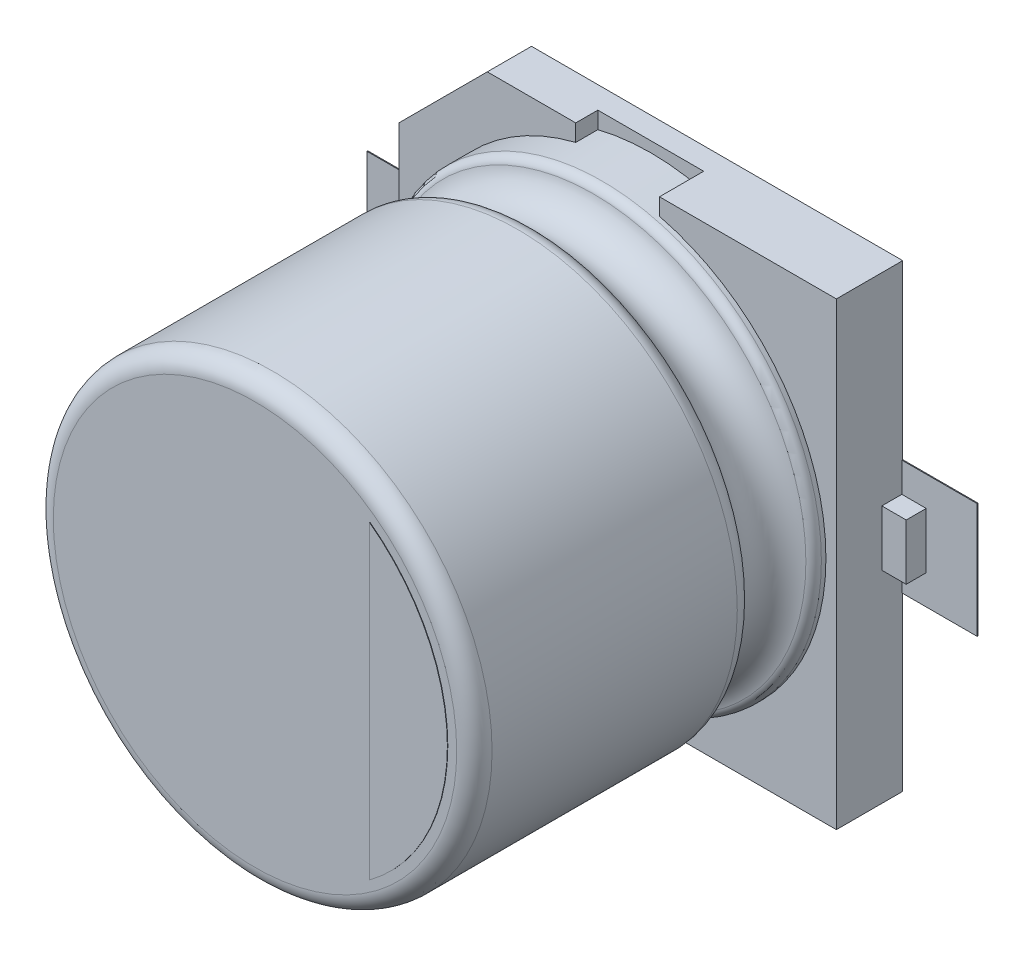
ISO-10303-21;
HEADER;
FILE_DESCRIPTION(('STEP AP214'),'2;1');
FILE_NAME('part.step','',(''),(''),'','','');
FILE_SCHEMA(('AUTOMOTIVE_DESIGN { 1 0 10303 214 1 1 1 1 }'));
ENDSEC;
DATA;
#1=APPLICATION_CONTEXT('core data for automotive mechanical design processes');
#2=APPLICATION_PROTOCOL_DEFINITION('international standard','automotive_design',2000,#1);
#3=PRODUCT_CONTEXT('',#1,'mechanical');
#4=PRODUCT('Part','Part','',(#3));
#5=PRODUCT_RELATED_PRODUCT_CATEGORY('part','',(#4));
#6=PRODUCT_DEFINITION_FORMATION('','',#4);
#7=PRODUCT_DEFINITION_CONTEXT('part definition',#1,'design');
#8=PRODUCT_DEFINITION('design','',#6,#7);
#9=PRODUCT_DEFINITION_SHAPE('','',#8);
#10=(LENGTH_UNIT() NAMED_UNIT(*) SI_UNIT(.MILLI.,.METRE.));
#11=(NAMED_UNIT(*) PLANE_ANGLE_UNIT() SI_UNIT($,.RADIAN.));
#12=(NAMED_UNIT(*) SI_UNIT($,.STERADIAN.) SOLID_ANGLE_UNIT());
#13=UNCERTAINTY_MEASURE_WITH_UNIT(LENGTH_MEASURE(1.E-05),#10,'distance_accuracy_value','');
#14=(GEOMETRIC_REPRESENTATION_CONTEXT(3) GLOBAL_UNCERTAINTY_ASSIGNED_CONTEXT((#13)) GLOBAL_UNIT_ASSIGNED_CONTEXT((#10,
#11,#12)) REPRESENTATION_CONTEXT('',''));
#15=CARTESIAN_POINT('',(0.,0.,0.));
#16=DIRECTION('',(0.,0.,1.));
#17=DIRECTION('',(1.,0.,0.));
#18=AXIS2_PLACEMENT_3D('',#15,#16,#17);
#19=CARTESIAN_POINT('',(0.,0.,6.082538));
#20=DIRECTION('',(0.,0.,1.));
#21=DIRECTION('',(1.,0.,0.));
#22=AXIS2_PLACEMENT_3D('',#19,#20,#21);
#23=PLANE('',#22);
#24=CARTESIAN_POINT('',(0.,0.,6.082538));
#25=DIRECTION('',(0.,0.,1.));
#26=DIRECTION('',(1.,0.,0.));
#27=AXIS2_PLACEMENT_3D('',#24,#25,#26);
#28=CIRCLE('',#27,2.7686291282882);
#29=CARTESIAN_POINT('',(1.651,2.22250000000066,6.082538));
#30=VERTEX_POINT('',#29);
#31=CARTESIAN_POINT('',(1.651,-2.22250000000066,6.082538));
#32=VERTEX_POINT('',#31);
#33=EDGE_CURVE('E235',#30,#32,#28,.F.);
#34=ORIENTED_EDGE('',*,*,#33,.F.);
#35=DIRECTION('',(0.,1.,0.));
#36=VECTOR('',#35,1.);
#37=CARTESIAN_POINT('',(1.651,2.2225,6.082538));
#38=LINE('',#37,#36);
#39=EDGE_CURVE('E229',#32,#30,#38,.T.);
#40=ORIENTED_EDGE('',*,*,#39,.F.);
#41=EDGE_LOOP('',(#34,#40));
#42=FACE_BOUND('',#41,.T.);
#43=ADVANCED_FACE('F16',(#42),#23,.T.);
#44=CARTESIAN_POINT('',(0.,0.,6.076188));
#45=DIRECTION('',(0.,0.,1.));
#46=DIRECTION('',(1.,0.,0.));
#47=AXIS2_PLACEMENT_3D('',#44,#45,#46);
#48=CYLINDRICAL_SURFACE('',#47,2.7686291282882);
#49=DIRECTION('',(0.,0.,1.));
#50=VECTOR('',#49,1.);
#51=CARTESIAN_POINT('',(1.651,-2.2225,6.076188));
#52=LINE('',#51,#50);
#53=CARTESIAN_POINT('',(1.651,-2.22250000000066,6.076188));
#54=VERTEX_POINT('',#53);
#55=EDGE_CURVE('E238',#54,#32,#52,.T.);
#56=ORIENTED_EDGE('',*,*,#55,.F.);
#57=CARTESIAN_POINT('',(0.,0.,6.076188));
#58=DIRECTION('',(0.,0.,1.));
#59=DIRECTION('',(1.,0.,0.));
#60=AXIS2_PLACEMENT_3D('',#57,#58,#59);
#61=CIRCLE('',#60,2.7686291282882);
#62=CARTESIAN_POINT('',(1.651,2.22250000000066,6.076188));
#63=VERTEX_POINT('',#62);
#64=EDGE_CURVE('E248',#63,#54,#61,.F.);
#65=ORIENTED_EDGE('',*,*,#64,.F.);
#66=DIRECTION('',(0.,0.,1.));
#67=VECTOR('',#66,1.);
#68=CARTESIAN_POINT('',(1.651,2.2225,6.076188));
#69=LINE('',#68,#67);
#70=EDGE_CURVE('E240',#30,#63,#69,.F.);
#71=ORIENTED_EDGE('',*,*,#70,.F.);
#72=ORIENTED_EDGE('',*,*,#33,.T.);
#73=EDGE_LOOP('',(#56,#65,#71,#72));
#74=FACE_BOUND('',#73,.T.);
#75=ADVANCED_FACE('F236',(#74),#48,.T.);
#76=CARTESIAN_POINT('',(1.651,2.2225,6.076188));
#77=DIRECTION('',(-1.,0.,0.));
#78=DIRECTION('',(0.,0.,1.));
#79=AXIS2_PLACEMENT_3D('',#76,#77,#78);
#80=PLANE('',#79);
#81=ORIENTED_EDGE('',*,*,#70,.T.);
#82=DIRECTION('',(0.,1.,0.));
#83=VECTOR('',#82,1.);
#84=CARTESIAN_POINT('',(1.651,0.,6.076188));
#85=LINE('',#84,#83);
#86=EDGE_CURVE('E245',#54,#63,#85,.T.);
#87=ORIENTED_EDGE('',*,*,#86,.F.);
#88=ORIENTED_EDGE('',*,*,#55,.T.);
#89=ORIENTED_EDGE('',*,*,#39,.T.);
#90=EDGE_LOOP('',(#81,#87,#88,#89));
#91=FACE_BOUND('',#90,.T.);
#92=ADVANCED_FACE('F243',(#91),#80,.T.);
#93=CARTESIAN_POINT('',(0.,0.,6.076188));
#94=DIRECTION('',(0.,0.,1.));
#95=DIRECTION('',(1.,0.,0.));
#96=AXIS2_PLACEMENT_3D('',#93,#94,#95);
#97=PLANE('',#96);
#98=ORIENTED_EDGE('',*,*,#64,.T.);
#99=ORIENTED_EDGE('',*,*,#86,.T.);
#100=EDGE_LOOP('',(#98,#99));
#101=FACE_BOUND('',#100,.T.);
#102=CARTESIAN_POINT('',(2.8959999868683,0.,6.076188));
#103=CARTESIAN_POINT('',(2.89600001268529,-0.00294739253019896,6.07618799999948));
#104=CARTESIAN_POINT('',(2.89599565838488,-0.00589479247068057,6.07618800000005));
#105=CARTESIAN_POINT('',(2.89598256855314,-0.010334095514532,6.07618799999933));
#106=CARTESIAN_POINT('',(2.8959770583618,-0.0118260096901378,6.07618799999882));
#107=CARTESIAN_POINT('',(2.89596377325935,-0.0148219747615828,6.0761879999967));
#108=CARTESIAN_POINT('',(2.89595598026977,-0.0163260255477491,6.07618799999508));
#109=CARTESIAN_POINT('',(2.89566917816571,-0.0644472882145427,6.07618799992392));
#110=CARTESIAN_POINT('',(2.89426628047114,-0.111065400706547,6.07618799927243));
#111=CARTESIAN_POINT('',(2.88921073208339,-0.204175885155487,6.07618799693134));
#112=CARTESIAN_POINT('',(2.88555805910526,-0.250668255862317,6.07618799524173));
#113=CARTESIAN_POINT('',(2.87601221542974,-0.343423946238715,6.07618799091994));
#114=CARTESIAN_POINT('',(2.87011902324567,-0.389687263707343,6.07618798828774));
#115=CARTESIAN_POINT('',(2.85610563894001,-0.48187552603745,6.07618798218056));
#116=CARTESIAN_POINT('',(2.84798542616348,-0.527800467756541,6.07618797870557));
#117=CARTESIAN_POINT('',(2.82953695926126,-0.619205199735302,6.07618797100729));
#118=CARTESIAN_POINT('',(2.81920868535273,-0.664684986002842,6.07618796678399));
#119=CARTESIAN_POINT('',(2.79636814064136,-0.755093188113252,6.07618795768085));
#120=CARTESIAN_POINT('',(2.78385585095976,-0.80002159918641,6.076187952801));
#121=CARTESIAN_POINT('',(2.75667642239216,-0.889222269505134,6.07618794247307));
#122=CARTESIAN_POINT('',(2.74200926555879,-0.93349452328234,6.07618793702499));
#123=CARTESIAN_POINT('',(2.7105543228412,-1.02127949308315,6.07618792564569));
#124=CARTESIAN_POINT('',(2.69376651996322,-1.06479220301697,6.07618791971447));
#125=CARTESIAN_POINT('',(2.65781622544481,-1.15166500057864,6.07618790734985));
#126=CARTESIAN_POINT('',(2.63861922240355,-1.1950108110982,6.0761879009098));
#127=CARTESIAN_POINT('',(2.59812093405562,-1.28070832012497,6.07618788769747));
#128=CARTESIAN_POINT('',(2.57681963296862,-1.32306001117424,6.0761878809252));
#129=CARTESIAN_POINT('',(2.53216403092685,-1.40666726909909,6.07618786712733));
#130=CARTESIAN_POINT('',(2.50880971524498,-1.44792282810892,6.07618786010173));
#131=CARTESIAN_POINT('',(2.46010435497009,-1.52923834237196,6.07618784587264));
#132=CARTESIAN_POINT('',(2.43475329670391,-1.56929828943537,6.07618783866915));
#133=CARTESIAN_POINT('',(2.38211552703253,-1.64812601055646,6.07618782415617));
#134=CARTESIAN_POINT('',(2.35482880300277,-1.68689377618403,6.07618781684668));
#135=CARTESIAN_POINT('',(2.29838544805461,-1.76304367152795,6.07618780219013));
#136=CARTESIAN_POINT('',(2.26922880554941,-1.80042579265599,6.07618779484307));
#137=CARTESIAN_POINT('',(2.20911586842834,-1.87371427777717,6.07618778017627));
#138=CARTESIAN_POINT('',(2.17815956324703,-1.90962063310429,6.07618777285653));
#139=CARTESIAN_POINT('',(2.11452189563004,-1.97987102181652,6.0761877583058));
#140=CARTESIAN_POINT('',(2.08184052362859,-2.0142150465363,6.07618775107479));
#141=CARTESIAN_POINT('',(2.01483147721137,-2.08125797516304,6.07618773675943));
#142=CARTESIAN_POINT('',(1.98050379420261,-2.11395687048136,6.07618772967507));
#143=CARTESIAN_POINT('',(1.91028485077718,-2.17763070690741,6.07618771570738));
#144=CARTESIAN_POINT('',(1.87439358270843,-2.20860563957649,6.07618770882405));
#145=CARTESIAN_POINT('',(1.80113396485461,-2.26875687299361,6.07618769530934));
#146=CARTESIAN_POINT('',(1.7637656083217,-2.29793316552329,6.07618768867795));
#147=CARTESIAN_POINT('',(1.68764187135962,-2.35441677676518,6.0761876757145));
#148=CARTESIAN_POINT('',(1.64888648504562,-2.38172408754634,6.07618766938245));
#149=CARTESIAN_POINT('',(1.57008209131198,-2.43440389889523,6.07618765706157));
#150=CARTESIAN_POINT('',(1.53003307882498,-2.45977639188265,6.07618765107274));
#151=CARTESIAN_POINT('',(1.44873795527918,-2.50852539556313,6.0761876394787));
#152=CARTESIAN_POINT('',(1.40749183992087,-2.53190189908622,6.07618763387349));
#153=CARTESIAN_POINT('',(1.32390192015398,-2.57660256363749,6.07618762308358));
#154=CARTESIAN_POINT('',(1.28155811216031,-2.59792671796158,6.07618761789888));
#155=CARTESIAN_POINT('',(1.19587486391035,-2.63847127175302,6.07618760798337));
#156=CARTESIAN_POINT('',(1.15253542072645,-2.6576916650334,6.07618760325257));
#157=CARTESIAN_POINT('',(1.06496536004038,-2.69398235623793,6.07618759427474));
#158=CARTESIAN_POINT('',(1.0207347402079,-2.71105264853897,6.07618759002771));
#159=CARTESIAN_POINT('',(0.93148893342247,-2.74300198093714,6.07618758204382));
#160=CARTESIAN_POINT('',(0.886473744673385,-2.75788101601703,6.07618757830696));
#161=CARTESIAN_POINT('',(0.795767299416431,-2.78541196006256,6.07618757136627));
#162=CARTESIAN_POINT('',(0.750076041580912,-2.79806386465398,6.07618756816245));
#163=CARTESIAN_POINT('',(0.658127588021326,-2.82111004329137,6.07618756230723));
#164=CARTESIAN_POINT('',(0.61187039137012,-2.8315043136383,6.07618755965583));
#165=CARTESIAN_POINT('',(0.518901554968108,-2.85001016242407,6.07618755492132));
#166=CARTESIAN_POINT('',(0.47218991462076,-2.85812173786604,6.07618755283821));
#167=CARTESIAN_POINT('',(0.378424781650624,-2.87204263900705,6.07618754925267));
#168=CARTESIAN_POINT('',(0.331371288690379,-2.87785196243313,6.07618754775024));
#169=CARTESIAN_POINT('',(0.237035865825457,-2.88715435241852,6.0761875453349));
#170=CARTESIAN_POINT('',(0.189753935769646,-2.89064741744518,6.07618754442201));
#171=CARTESIAN_POINT('',(0.09507560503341,-2.89530886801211,6.07618754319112));
#172=CARTESIAN_POINT('',(0.047679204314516,-2.89647725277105,6.07618754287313));
#173=CARTESIAN_POINT('',(-0.0471138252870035,-2.8964865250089,6.07618754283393));
#174=CARTESIAN_POINT('',(-0.0945104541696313,-2.89532741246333,6.07618754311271));
#175=CARTESIAN_POINT('',(-0.189189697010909,-2.89068448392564,6.07618754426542));
#176=CARTESIAN_POINT('',(-0.236472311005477,-2.88720066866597,6.07618754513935));
#177=CARTESIAN_POINT('',(-0.330809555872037,-2.87791673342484,6.0761875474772));
#178=CARTESIAN_POINT('',(-0.377864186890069,-2.87211661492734,6.07618754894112));
#179=CARTESIAN_POINT('',(-0.471632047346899,-2.85821405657,6.07618755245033));
#180=CARTESIAN_POINT('',(-0.518345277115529,-2.85011161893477,6.07618755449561));
#181=CARTESIAN_POINT('',(-0.611317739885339,-2.83162395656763,6.0761875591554));
#182=CARTESIAN_POINT('',(-0.657576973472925,-2.8212387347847,6.0761875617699));
#183=CARTESIAN_POINT('',(-0.749529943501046,-2.7982105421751,6.07618756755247));
#184=CARTESIAN_POINT('',(-0.795223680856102,-2.78556757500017,6.07618757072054));
#185=CARTESIAN_POINT('',(-0.885935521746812,-2.75805437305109,6.0761875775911));
#186=CARTESIAN_POINT('',(-0.930953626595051,-2.74318414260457,6.0761875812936));
#187=CARTESIAN_POINT('',(-1.02020569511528,-2.71125226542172,6.07618758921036));
#188=CARTESIAN_POINT('',(-1.06443966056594,-2.6941906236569,6.07618759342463));
#189=CARTESIAN_POINT('',(-1.15201683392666,-2.65791705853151,6.07618760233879));
#190=CARTESIAN_POINT('',(-1.19536004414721,-2.63870514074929,6.07618760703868));
#191=CARTESIAN_POINT('',(-1.28105123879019,-2.59817734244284,6.07618761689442));
#192=CARTESIAN_POINT('',(-1.32339922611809,-2.57686146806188,6.07618762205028));
#193=CARTESIAN_POINT('',(-1.40699790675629,-2.53217714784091,6.0761876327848));
#194=CARTESIAN_POINT('',(-1.44824860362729,-2.5088087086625,6.07618763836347));
#195=CARTESIAN_POINT('',(-1.52955328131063,-2.46007559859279,6.07618764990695));
#196=CARTESIAN_POINT('',(-1.56960726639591,-2.43471093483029,6.07618765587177));
#197=CARTESIAN_POINT('',(-1.64842198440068,-2.38204652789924,6.07618766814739));
#198=CARTESIAN_POINT('',(-1.68718272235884,-2.35474679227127,6.0761876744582));
#199=CARTESIAN_POINT('',(-1.76331752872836,-2.2982780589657,6.07618768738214));
#200=CARTESIAN_POINT('',(-1.80069160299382,-2.26910906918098,6.07618769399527));
#201=CARTESIAN_POINT('',(-1.87396300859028,-2.20897215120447,6.07618770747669));
#202=CARTESIAN_POINT('',(-1.90986034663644,-2.17800423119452,6.07618771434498));
#203=CARTESIAN_POINT('',(-1.98009176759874,-2.11434411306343,6.07618772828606));
#204=CARTESIAN_POINT('',(-2.01442585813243,-2.08165192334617,6.07618773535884));
#205=CARTESIAN_POINT('',(-2.08144804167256,-2.01462208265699,6.07618774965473));
#206=CARTESIAN_POINT('',(-2.11413614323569,-1.98028444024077,6.07618775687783));
#207=CARTESIAN_POINT('',(-2.17778757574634,-1.91004647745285,6.07618777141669));
#208=CARTESIAN_POINT('',(-2.20875091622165,-1.87414616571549,6.07618777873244));
#209=CARTESIAN_POINT('',(-2.26887821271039,-1.80086941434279,6.07618779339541));
#210=CARTESIAN_POINT('',(-2.29804217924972,-1.76349298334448,6.07618780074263));
#211=CARTESIAN_POINT('',(-2.3545004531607,-1.68735410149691,6.07618781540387));
#212=CARTESIAN_POINT('',(-2.38179477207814,-1.64859165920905,6.07618782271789));
#213=CARTESIAN_POINT('',(-2.43444798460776,-1.56977420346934,6.07618783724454));
#214=CARTESIAN_POINT('',(-2.45980689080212,-1.52971919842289,6.07618784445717));
#215=CARTESIAN_POINT('',(-2.50852817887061,-1.44841318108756,6.07618785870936));
#216=CARTESIAN_POINT('',(-2.53189057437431,-1.40716217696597,6.07618786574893));
#217=CARTESIAN_POINT('',(-2.57656255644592,-1.32356360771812,6.0761878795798));
#218=CARTESIAN_POINT('',(-2.59787215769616,-1.28121605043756,6.07618788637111));
#219=CARTESIAN_POINT('',(-2.6383872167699,-1.19552646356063,6.07618789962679));
#220=CARTESIAN_POINT('',(-2.65759269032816,-1.15218444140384,6.07618790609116));
#221=CARTESIAN_POINT('',(-2.69385323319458,-1.06461040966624,6.07618791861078));
#222=CARTESIAN_POINT('',(-2.71090831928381,-1.02037840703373,6.07618792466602));
#223=CARTESIAN_POINT('',(-2.74282701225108,-0.931131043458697,6.07618793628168));
#224=CARTESIAN_POINT('',(-2.75769063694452,-0.88611568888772,6.0761879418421));
#225=CARTESIAN_POINT('',(-2.78519061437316,-0.795410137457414,6.07618795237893));
#226=CARTESIAN_POINT('',(-2.79782698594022,-0.749719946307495,6.07618795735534));
#227=CARTESIAN_POINT('',(-2.82084204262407,-0.657774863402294,6.07618796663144));
#228=CARTESIAN_POINT('',(-2.83122074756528,-0.611519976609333,6.07618797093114));
#229=CARTESIAN_POINT('',(-2.84969547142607,-0.518557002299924,6.07618797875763));
#230=CARTESIAN_POINT('',(-2.8577915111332,-0.471848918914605,6.07618798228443));
#231=CARTESIAN_POINT('',(-2.87168151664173,-0.378092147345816,6.07618798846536));
#232=CARTESIAN_POINT('',(-2.8774755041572,-0.331043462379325,6.07618799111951));
#233=CARTESIAN_POINT('',(-2.88674716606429,-0.23671888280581,6.07618799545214));
#234=CARTESIAN_POINT('',(-2.89022486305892,-0.189442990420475,6.07618799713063));
#235=CARTESIAN_POINT('',(-2.89485678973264,-0.0947780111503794,6.0761879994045));
#236=CARTESIAN_POINT('',(-2.89601104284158,-0.047388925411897,6.07618799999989));
#237=CARTESIAN_POINT('',(-2.8959999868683,0.,6.076188));
#238=B_SPLINE_CURVE_WITH_KNOTS('',3,(#102,#103,#104,#105,#106,#107,#108,#109,#110,#111,#112,
#113,#114,#115,#116,#117,#118,#119,#120,#121,#122,#123,#124,#125,#126,#127,#128,#129,#130,#131,
#132,#133,#134,#135,#136,#137,#138,#139,#140,#141,#142,#143,#144,#145,#146,#147,#148,#149,#150,
#151,#152,#153,#154,#155,#156,#157,#158,#159,#160,#161,#162,#163,#164,#165,#166,#167,#168,#169,
#170,#171,#172,#173,#174,#175,#176,#177,#178,#179,#180,#181,#182,#183,#184,#185,#186,#187,#188,
#189,#190,#191,#192,#193,#194,#195,#196,#197,#198,#199,#200,#201,#202,#203,#204,#205,#206,#207,
#208,#209,#210,#211,#212,#213,#214,#215,#216,#217,#218,#219,#220,#221,#222,#223,#224,#225,#226,
#227,#228,#229,#230,#231,#232,#233,#234,#235,#236,#237),.UNSPECIFIED.,.F.,.F.,(4,2,2,2,2,2,2,2,
2,2,2,2,2,2,2,2,2,2,2,2,2,2,2,2,2,2,2,2,2,2,2,2,2,2,2,2,2,2,2,2,2,2,2,2,2,2,2,2,2,2,2,2,2,2,2,2,
2,2,2,2,2,2,2,2,2,2,2,4),(0.,0.00884218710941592,0.0133179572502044,0.0178301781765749,
0.157683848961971,0.297538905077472,0.437395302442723,0.577252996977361,0.717111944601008,
0.856972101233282,0.996833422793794,1.13669586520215,1.27885832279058,1.42102184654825,
1.56318639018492,1.70535190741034,1.84751835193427,1.98968567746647,2.13185383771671,
2.27402278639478,2.41619247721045,2.55836286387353,2.70053390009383,2.84270553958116,
2.98487773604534,3.12705044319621,3.26922361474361,3.41139720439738,3.5535711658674,
3.69574545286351,3.8379200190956,3.98009481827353,4.12226980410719,4.26444493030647,
4.40662015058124,4.54879541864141,4.69097068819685,4.83314591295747,4.97532104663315,
5.11749604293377,5.25967085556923,5.4018454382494,5.54401974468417,5.6861937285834,
5.82836734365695,5.9705405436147,6.11271328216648,6.25488551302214,6.39705718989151,
6.53922826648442,6.6813986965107,6.82356843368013,6.96573743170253,7.10790564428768,
7.25007302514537,7.39223952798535,7.53440510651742,7.67656971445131,7.81873330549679,
7.96089583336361,8.1030572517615,8.24521751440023,8.38737657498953,8.52953438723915,
8.67169090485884,8.81384608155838,8.95599987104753,9.09815222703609),.UNSPECIFIED.);
#239=CARTESIAN_POINT('',(2.89599998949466,0.,6.076188));
#240=VERTEX_POINT('',#239);
#241=CARTESIAN_POINT('',(-2.89599998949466,0.,6.076188));
#242=VERTEX_POINT('',#241);
#243=EDGE_CURVE('E269',#240,#242,#238,.T.);
#244=ORIENTED_EDGE('',*,*,#243,.F.);
#245=CARTESIAN_POINT('',(0.,0.,6.076188));
#246=DIRECTION('',(0.,0.,-1.));
#247=DIRECTION('',(-1.,0.,0.));
#248=AXIS2_PLACEMENT_3D('',#245,#246,#247);
#249=CIRCLE('',#248,2.8959999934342);
#250=EDGE_CURVE('E272',#242,#240,#249,.T.);
#251=ORIENTED_EDGE('',*,*,#250,.F.);
#252=EDGE_LOOP('',(#244,#251));
#253=FACE_BOUND('',#252,.T.);
#254=ADVANCED_FACE('F277',(#101,#253),#97,.T.);
#255=CARTESIAN_POINT('',(0.,0.,5.822188));
#256=DIRECTION('',(0.,0.,1.));
#257=DIRECTION('',(0.99998104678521,-0.00615679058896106,0.));
#258=AXIS2_PLACEMENT_3D('',#255,#256,#257);
#259=TOROIDAL_SURFACE('',#258,2.8960000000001,0.254);
#260=CARTESIAN_POINT('',(0.,0.,5.822188));
#261=DIRECTION('',(0.,0.,1.));
#262=DIRECTION('',(1.,0.,0.));
#263=AXIS2_PLACEMENT_3D('',#260,#261,#262);
#264=CIRCLE('',#263,3.1500000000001);
#265=CARTESIAN_POINT('',(3.1500000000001,0.,5.822188));
#266=VERTEX_POINT('',#265);
#267=EDGE_CURVE('E278',#266,#266,#264,.F.);
#268=ORIENTED_EDGE('',*,*,#267,.F.);
#269=EDGE_LOOP('',(#268));
#270=FACE_BOUND('',#269,.T.);
#271=ORIENTED_EDGE('',*,*,#250,.T.);
#272=ORIENTED_EDGE('',*,*,#243,.T.);
#273=EDGE_LOOP('',(#271,#272));
#274=FACE_BOUND('',#273,.T.);
#275=ADVANCED_FACE('F271',(#270,#274),#259,.T.);
#276=CARTESIAN_POINT('',(0.,0.,0.0762));
#277=DIRECTION('',(0.,0.,1.));
#278=DIRECTION('',(1.,0.,0.));
#279=AXIS2_PLACEMENT_3D('',#276,#277,#278);
#280=CYLINDRICAL_SURFACE('',#279,3.1500000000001);
#281=CARTESIAN_POINT('',(0.,0.,2.30168137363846));
#282=DIRECTION('',(0.,0.,1.));
#283=DIRECTION('',(0.999979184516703,-0.00645217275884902,0.));
#284=AXIS2_PLACEMENT_3D('',#281,#282,#283);
#285=CIRCLE('',#284,3.1500000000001);
#286=CARTESIAN_POINT('',(3.14993443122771,-0.0203243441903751,2.30168137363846));
#287=VERTEX_POINT('',#286);
#288=EDGE_CURVE('E469',#287,#287,#285,.F.);
#289=ORIENTED_EDGE('',*,*,#288,.F.);
#290=EDGE_LOOP('',(#289));
#291=FACE_BOUND('',#290,.T.);
#292=ORIENTED_EDGE('',*,*,#267,.T.);
#293=EDGE_LOOP('',(#292));
#294=FACE_BOUND('',#293,.T.);
#295=ADVANCED_FACE('F465',(#291,#294),#280,.T.);
#296=CARTESIAN_POINT('',(0.,0.,2.30168137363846));
#297=DIRECTION('',(0.,0.,1.));
#298=DIRECTION('',(0.999979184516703,-0.00645217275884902,0.));
#299=AXIS2_PLACEMENT_3D('',#296,#297,#298);
#300=TOROIDAL_SURFACE('',#299,2.8960000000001,0.254);
#301=CARTESIAN_POINT('',(0.,0.,2.06506997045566));
#302=DIRECTION('',(0.,0.,-1.));
#303=DIRECTION('',(0.,-1.,0.));
#304=AXIS2_PLACEMENT_3D('',#301,#302,#303);
#305=CIRCLE('',#304,2.98836365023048);
#306=CARTESIAN_POINT('',(0.,-2.98836365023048,2.06506997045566));
#307=VERTEX_POINT('',#306);
#308=EDGE_CURVE('E455',#307,#307,#305,.F.);
#309=ORIENTED_EDGE('',*,*,#308,.T.);
#310=EDGE_LOOP('',(#309));
#311=FACE_BOUND('',#310,.T.);
#312=ORIENTED_EDGE('',*,*,#288,.T.);
#313=EDGE_LOOP('',(#312));
#314=FACE_BOUND('',#313,.T.);
#315=ADVANCED_FACE('F462',(#311,#314),#300,.T.);
#316=CARTESIAN_POINT('',(0.,0.,1.651));
#317=DIRECTION('',(0.,0.,-1.));
#318=DIRECTION('',(0.,-1.,0.));
#319=AXIS2_PLACEMENT_3D('',#316,#317,#318);
#320=TOROIDAL_SURFACE('',#319,3.1500000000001,0.4445);
#321=ORIENTED_EDGE('',*,*,#308,.F.);
#322=EDGE_LOOP('',(#321));
#323=FACE_BOUND('',#322,.T.);
#324=CARTESIAN_POINT('',(0.,0.,1.21761425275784));
#325=DIRECTION('',(0.,0.,1.));
#326=DIRECTION('',(-0.99998248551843,-0.00591850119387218,0.));
#327=AXIS2_PLACEMENT_3D('',#324,#325,#326);
#328=CIRCLE('',#327,3.05122224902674);
#329=CARTESIAN_POINT('',(-3.0511688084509,-0.0180586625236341,1.21761425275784));
#330=VERTEX_POINT('',#329);
#331=EDGE_CURVE('E451',#330,#330,#328,.F.);
#332=ORIENTED_EDGE('',*,*,#331,.F.);
#333=EDGE_LOOP('',(#332));
#334=FACE_BOUND('',#333,.T.);
#335=ADVANCED_FACE('F459',(#323,#334),#320,.F.);
#336=CARTESIAN_POINT('',(0.,0.,0.37620000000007));
#337=DIRECTION('',(0.,0.,1.));
#338=DIRECTION('',(1.,0.,0.));
#339=AXIS2_PLACEMENT_3D('',#336,#337,#338);
#340=PLANE('',#339);
#341=DIRECTION('',(1.,0.,0.));
#342=VECTOR('',#341,1.);
#343=CARTESIAN_POINT('',(-3.65000000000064,-0.399999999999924,0.37620000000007));
#344=LINE('',#343,#342);
#345=CARTESIAN_POINT('',(-3.2999999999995,-0.399999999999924,0.37620000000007));
#346=VERTEX_POINT('',#345);
#347=CARTESIAN_POINT('',(-3.65000000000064,-0.399999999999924,0.37620000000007));
#348=VERTEX_POINT('',#347);
#349=EDGE_CURVE('E454',#346,#348,#344,.F.);
#350=ORIENTED_EDGE('',*,*,#349,.F.);
#351=DIRECTION('',(0.,1.,0.));
#352=VECTOR('',#351,1.);
#353=CARTESIAN_POINT('',(-3.2999999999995,2.03000000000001,0.37620000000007));
#354=LINE('',#353,#352);
#355=CARTESIAN_POINT('',(-3.2999999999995,0.399999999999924,0.37620000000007));
#356=VERTEX_POINT('',#355);
#357=EDGE_CURVE('E818',#356,#346,#354,.F.);
#358=ORIENTED_EDGE('',*,*,#357,.F.);
#359=DIRECTION('',(1.,0.,0.));
#360=VECTOR('',#359,1.);
#361=CARTESIAN_POINT('',(-1.05000000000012,0.399999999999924,0.37620000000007));
#362=LINE('',#361,#360);
#363=CARTESIAN_POINT('',(-3.65000000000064,0.399999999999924,0.37620000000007));
#364=VERTEX_POINT('',#363);
#365=EDGE_CURVE('E839',#364,#356,#362,.T.);
#366=ORIENTED_EDGE('',*,*,#365,.F.);
#367=DIRECTION('',(0.,1.,0.));
#368=VECTOR('',#367,1.);
#369=CARTESIAN_POINT('',(-3.65000000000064,0.399999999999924,0.37620000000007));
#370=LINE('',#369,#368);
#371=EDGE_CURVE('E819',#348,#364,#370,.T.);
#372=ORIENTED_EDGE('',*,*,#371,.F.);
#373=EDGE_LOOP('',(#350,#358,#366,#372));
#374=FACE_BOUND('',#373,.T.);
#375=ADVANCED_FACE('F437',(#374),#340,.T.);
#376=CARTESIAN_POINT('',(0.,0.,1.09378976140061));
#377=DIRECTION('',(0.,0.,1.));
#378=DIRECTION('',(-0.99998248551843,-0.00591850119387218,0.));
#379=AXIS2_PLACEMENT_3D('',#376,#377,#378);
#380=TOROIDAL_SURFACE('',#379,3.0230000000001,0.127);
#381=ORIENTED_EDGE('',*,*,#331,.T.);
#382=EDGE_LOOP('',(#381));
#383=FACE_BOUND('',#382,.T.);
#384=CARTESIAN_POINT('',(0.,0.,1.09378976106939));
#385=DIRECTION('',(0.,0.,1.));
#386=DIRECTION('',(1.,0.,0.));
#387=AXIS2_PLACEMENT_3D('',#384,#385,#386);
#388=CIRCLE('',#387,3.1500000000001);
#389=CARTESIAN_POINT('',(3.1500000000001,0.,1.09378976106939));
#390=VERTEX_POINT('',#389);
#391=EDGE_CURVE('E445',#390,#390,#388,.F.);
#392=ORIENTED_EDGE('',*,*,#391,.F.);
#393=EDGE_LOOP('',(#392));
#394=FACE_BOUND('',#393,.T.);
#395=ADVANCED_FACE('F432',(#383,#394),#380,.T.);
#396=CARTESIAN_POINT('',(3.65000000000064,-0.399999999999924,0.0762));
#397=DIRECTION('',(1.,0.,0.));
#398=DIRECTION('',(0.,0.,-1.));
#399=AXIS2_PLACEMENT_3D('',#396,#397,#398);
#400=PLANE('',#399);
#401=DIRECTION('',(0.,0.,-1.));
#402=VECTOR('',#401,1.);
#403=CARTESIAN_POINT('',(3.65000000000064,-0.399999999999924,0.0762));
#404=LINE('',#403,#402);
#405=CARTESIAN_POINT('',(3.65000000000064,-0.399999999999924,0.0889));
#406=VERTEX_POINT('',#405);
#407=CARTESIAN_POINT('',(3.65000000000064,-0.399999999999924,0.37620000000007));
#408=VERTEX_POINT('',#407);
#409=EDGE_CURVE('E950',#406,#408,#404,.F.);
#410=ORIENTED_EDGE('',*,*,#409,.F.);
#411=DIRECTION('',(0.,1.,0.));
#412=VECTOR('',#411,1.);
#413=CARTESIAN_POINT('',(3.65000000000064,0.,0.0889));
#414=LINE('',#413,#412);
#415=CARTESIAN_POINT('',(3.65000000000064,0.399999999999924,0.0889));
#416=VERTEX_POINT('',#415);
#417=EDGE_CURVE('E448',#416,#406,#414,.F.);
#418=ORIENTED_EDGE('',*,*,#417,.F.);
#419=DIRECTION('',(0.,0.,1.));
#420=VECTOR('',#419,1.);
#421=CARTESIAN_POINT('',(3.65000000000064,0.399999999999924,0.0762));
#422=LINE('',#421,#420);
#423=CARTESIAN_POINT('',(3.65000000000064,0.399999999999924,0.37620000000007));
#424=VERTEX_POINT('',#423);
#425=EDGE_CURVE('E937',#424,#416,#422,.F.);
#426=ORIENTED_EDGE('',*,*,#425,.F.);
#427=DIRECTION('',(0.,1.,0.));
#428=VECTOR('',#427,1.);
#429=CARTESIAN_POINT('',(3.65000000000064,0.,0.37620000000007));
#430=LINE('',#429,#428);
#431=EDGE_CURVE('E942',#408,#424,#430,.T.);
#432=ORIENTED_EDGE('',*,*,#431,.F.);
#433=EDGE_LOOP('',(#410,#418,#426,#432));
#434=FACE_BOUND('',#433,.T.);
#435=ADVANCED_FACE('F428',(#434),#400,.T.);
#436=CARTESIAN_POINT('',(-3.65000000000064,-0.399999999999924,0.0762));
#437=DIRECTION('',(0.,-1.,0.));
#438=DIRECTION('',(0.,0.,-1.));
#439=AXIS2_PLACEMENT_3D('',#436,#437,#438);
#440=PLANE('',#439);
#441=DIRECTION('',(0.,0.,1.));
#442=VECTOR('',#441,1.);
#443=CARTESIAN_POINT('',(-3.65000000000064,-0.399999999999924,0.0762));
#444=LINE('',#443,#442);
#445=CARTESIAN_POINT('',(-3.65000000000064,-0.399999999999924,0.0889));
#446=VERTEX_POINT('',#445);
#447=EDGE_CURVE('E822',#446,#348,#444,.T.);
#448=ORIENTED_EDGE('',*,*,#447,.F.);
#449=DIRECTION('',(1.,0.,0.));
#450=VECTOR('',#449,1.);
#451=CARTESIAN_POINT('',(0.,-0.399999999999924,0.0889));
#452=LINE('',#451,#450);
#453=CARTESIAN_POINT('',(-3.2999999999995,-0.399999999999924,0.0889));
#454=VERTEX_POINT('',#453);
#455=EDGE_CURVE('E826',#454,#446,#452,.F.);
#456=ORIENTED_EDGE('',*,*,#455,.F.);
#457=DIRECTION('',(0.,0.,1.));
#458=VECTOR('',#457,1.);
#459=CARTESIAN_POINT('',(-3.2999999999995,-0.399999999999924,0.0762));
#460=LINE('',#459,#458);
#461=EDGE_CURVE('E825',#346,#454,#460,.F.);
#462=ORIENTED_EDGE('',*,*,#461,.F.);
#463=ORIENTED_EDGE('',*,*,#349,.T.);
#464=EDGE_LOOP('',(#448,#456,#462,#463));
#465=FACE_BOUND('',#464,.T.);
#466=ADVANCED_FACE('F424',(#465),#440,.T.);
#467=CARTESIAN_POINT('',(-3.65000000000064,0.399999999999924,0.0762));
#468=DIRECTION('',(-1.,0.,0.));
#469=DIRECTION('',(0.,0.,1.));
#470=AXIS2_PLACEMENT_3D('',#467,#468,#469);
#471=PLANE('',#470);
#472=DIRECTION('',(0.,0.,1.));
#473=VECTOR('',#472,1.);
#474=CARTESIAN_POINT('',(-3.65000000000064,0.399999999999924,0.0762));
#475=LINE('',#474,#473);
#476=CARTESIAN_POINT('',(-3.65000000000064,0.399999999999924,0.0889));
#477=VERTEX_POINT('',#476);
#478=EDGE_CURVE('E854',#477,#364,#475,.T.);
#479=ORIENTED_EDGE('',*,*,#478,.F.);
#480=DIRECTION('',(0.,1.,0.));
#481=VECTOR('',#480,1.);
#482=CARTESIAN_POINT('',(-3.65000000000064,0.,0.0889));
#483=LINE('',#482,#481);
#484=EDGE_CURVE('E921',#446,#477,#483,.T.);
#485=ORIENTED_EDGE('',*,*,#484,.F.);
#486=ORIENTED_EDGE('',*,*,#447,.T.);
#487=ORIENTED_EDGE('',*,*,#371,.T.);
#488=EDGE_LOOP('',(#479,#485,#486,#487));
#489=FACE_BOUND('',#488,.T.);
#490=ADVANCED_FACE('F420',(#489),#471,.T.);
#491=CARTESIAN_POINT('',(-1.05000000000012,0.399999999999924,0.0762));
#492=DIRECTION('',(0.,1.,0.));
#493=DIRECTION('',(0.,0.,1.));
#494=AXIS2_PLACEMENT_3D('',#491,#492,#493);
#495=PLANE('',#494);
#496=DIRECTION('',(0.,0.,1.));
#497=VECTOR('',#496,1.);
#498=CARTESIAN_POINT('',(-3.2999999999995,0.399999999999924,0.0762));
#499=LINE('',#498,#497);
#500=CARTESIAN_POINT('',(-3.2999999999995,0.399999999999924,0.0889));
#501=VERTEX_POINT('',#500);
#502=EDGE_CURVE('E833',#501,#356,#499,.T.);
#503=ORIENTED_EDGE('',*,*,#502,.F.);
#504=DIRECTION('',(1.,0.,0.));
#505=VECTOR('',#504,1.);
#506=CARTESIAN_POINT('',(0.,0.399999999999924,0.0889));
#507=LINE('',#506,#505);
#508=EDGE_CURVE('E919',#477,#501,#507,.T.);
#509=ORIENTED_EDGE('',*,*,#508,.F.);
#510=ORIENTED_EDGE('',*,*,#478,.T.);
#511=ORIENTED_EDGE('',*,*,#365,.T.);
#512=EDGE_LOOP('',(#503,#509,#510,#511));
#513=FACE_BOUND('',#512,.T.);
#514=ADVANCED_FACE('F416',(#513),#495,.T.);
#515=CARTESIAN_POINT('',(-3.2999999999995,2.03000000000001,0.0762));
#516=DIRECTION('',(-1.,0.,0.));
#517=DIRECTION('',(0.,0.,1.));
#518=AXIS2_PLACEMENT_3D('',#515,#516,#517);
#519=PLANE('',#518);
#520=DIRECTION('',(0.,0.,1.));
#521=VECTOR('',#520,1.);
#522=CARTESIAN_POINT('',(-3.2999999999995,0.8255,0.0762));
#523=LINE('',#522,#521);
#524=CARTESIAN_POINT('',(-3.2999999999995,0.8255,0.0762));
#525=VERTEX_POINT('',#524);
#526=CARTESIAN_POINT('',(-3.2999999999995,0.8255,0.0889));
#527=VERTEX_POINT('',#526);
#528=EDGE_CURVE('E1000',#525,#527,#523,.T.);
#529=ORIENTED_EDGE('',*,*,#528,.T.);
#530=DIRECTION('',(0.,1.,0.));
#531=VECTOR('',#530,1.);
#532=CARTESIAN_POINT('',(-3.2999999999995,0.,0.0889));
#533=LINE('',#532,#531);
#534=EDGE_CURVE('E914',#501,#527,#533,.T.);
#535=ORIENTED_EDGE('',*,*,#534,.F.);
#536=ORIENTED_EDGE('',*,*,#502,.T.);
#537=ORIENTED_EDGE('',*,*,#357,.T.);
#538=ORIENTED_EDGE('',*,*,#461,.T.);
#539=DIRECTION('',(0.,1.,0.));
#540=VECTOR('',#539,1.);
#541=CARTESIAN_POINT('',(-3.2999999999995,0.,0.0889));
#542=LINE('',#541,#540);
#543=CARTESIAN_POINT('',(-3.2999999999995,-0.8255,0.0889));
#544=VERTEX_POINT('',#543);
#545=EDGE_CURVE('E924',#544,#454,#542,.T.);
#546=ORIENTED_EDGE('',*,*,#545,.F.);
#547=DIRECTION('',(0.,0.,1.));
#548=VECTOR('',#547,1.);
#549=CARTESIAN_POINT('',(-3.2999999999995,-0.8255,0.0762));
#550=LINE('',#549,#548);
#551=CARTESIAN_POINT('',(-3.2999999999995,-0.8255,0.0762));
#552=VERTEX_POINT('',#551);
#553=EDGE_CURVE('E829',#544,#552,#550,.F.);
#554=ORIENTED_EDGE('',*,*,#553,.T.);
#555=DIRECTION('',(0.,1.,0.));
#556=VECTOR('',#555,1.);
#557=CARTESIAN_POINT('',(-3.2999999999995,2.03000000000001,0.0762));
#558=LINE('',#557,#556);
#559=CARTESIAN_POINT('',(-3.2999999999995,-2.03000000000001,0.0762));
#560=VERTEX_POINT('',#559);
#561=EDGE_CURVE('E831',#552,#560,#558,.F.);
#562=ORIENTED_EDGE('',*,*,#561,.T.);
#563=DIRECTION('',(0.,0.,1.));
#564=VECTOR('',#563,1.);
#565=CARTESIAN_POINT('',(-3.2999999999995,-2.03000000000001,0.0762));
#566=LINE('',#565,#564);
#567=CARTESIAN_POINT('',(-3.2999999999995,-2.03000000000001,0.7112));
#568=VERTEX_POINT('',#567);
#569=EDGE_CURVE('E1016',#560,#568,#566,.T.);
#570=ORIENTED_EDGE('',*,*,#569,.T.);
#571=DIRECTION('',(0.,1.,0.));
#572=VECTOR('',#571,1.);
#573=CARTESIAN_POINT('',(-3.2999999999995,0.,0.7112));
#574=LINE('',#573,#572);
#575=CARTESIAN_POINT('',(-3.2999999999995,2.03000000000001,0.7112));
#576=VERTEX_POINT('',#575);
#577=EDGE_CURVE('E909',#576,#568,#574,.F.);
#578=ORIENTED_EDGE('',*,*,#577,.F.);
#579=DIRECTION('',(0.,0.,1.));
#580=VECTOR('',#579,1.);
#581=CARTESIAN_POINT('',(-3.2999999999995,2.03000000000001,0.0762));
#582=LINE('',#581,#580);
#583=CARTESIAN_POINT('',(-3.2999999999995,2.03000000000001,0.0762));
#584=VERTEX_POINT('',#583);
#585=EDGE_CURVE('E1014',#576,#584,#582,.F.);
#586=ORIENTED_EDGE('',*,*,#585,.T.);
#587=DIRECTION('',(0.,1.,0.));
#588=VECTOR('',#587,1.);
#589=CARTESIAN_POINT('',(-3.2999999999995,2.03000000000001,0.0762));
#590=LINE('',#589,#588);
#591=EDGE_CURVE('E1012',#584,#525,#590,.F.);
#592=ORIENTED_EDGE('',*,*,#591,.T.);
#593=EDGE_LOOP('',(#529,#535,#536,#537,#538,#546,#554,#562,#570,#578,#586,#592));
#594=FACE_BOUND('',#593,.T.);
#595=ADVANCED_FACE('F412',(#594),#519,.T.);
#596=CARTESIAN_POINT('',(0.,0.,0.0762));
#597=DIRECTION('',(0.,0.,1.));
#598=DIRECTION('',(1.,0.,0.));
#599=AXIS2_PLACEMENT_3D('',#596,#597,#598);
#600=CYLINDRICAL_SURFACE('',#599,3.1500000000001);
#601=DIRECTION('',(0.,0.,1.));
#602=VECTOR('',#601,1.);
#603=CARTESIAN_POINT('',(0.760000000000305,-3.05694291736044,0.0762));
#604=LINE('',#603,#602);
#605=CARTESIAN_POINT('',(0.760000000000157,-3.05694291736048,0.3937));
#606=VERTEX_POINT('',#605);
#607=CARTESIAN_POINT('',(0.760000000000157,-3.05694291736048,1.0287));
#608=VERTEX_POINT('',#607);
#609=EDGE_CURVE('E265',#606,#608,#604,.T.);
#610=ORIENTED_EDGE('',*,*,#609,.T.);
#611=CARTESIAN_POINT('',(0.,0.,1.0287));
#612=DIRECTION('',(0.,0.,1.));
#613=DIRECTION('',(1.,0.,0.));
#614=AXIS2_PLACEMENT_3D('',#611,#612,#613);
#615=CIRCLE('',#614,3.1500000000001);
#616=CARTESIAN_POINT('',(0.760000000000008,3.05694291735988,1.0287));
#617=VERTEX_POINT('',#616);
#618=EDGE_CURVE('E251',#617,#608,#615,.F.);
#619=ORIENTED_EDGE('',*,*,#618,.F.);
#620=DIRECTION('',(0.,0.,1.));
#621=VECTOR('',#620,1.);
#622=CARTESIAN_POINT('',(0.760000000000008,3.05694291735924,0.3937));
#623=LINE('',#622,#621);
#624=CARTESIAN_POINT('',(0.760000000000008,3.05694291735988,0.3937));
#625=VERTEX_POINT('',#624);
#626=EDGE_CURVE('E841',#625,#617,#623,.T.);
#627=ORIENTED_EDGE('',*,*,#626,.F.);
#628=CARTESIAN_POINT('',(0.,0.,0.3937));
#629=DIRECTION('',(0.,0.,1.));
#630=DIRECTION('',(1.,0.,0.));
#631=AXIS2_PLACEMENT_3D('',#628,#629,#630);
#632=CIRCLE('',#631,3.1500000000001);
#633=CARTESIAN_POINT('',(-0.760000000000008,3.05694291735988,0.3937));
#634=VERTEX_POINT('',#633);
#635=EDGE_CURVE('E259',#634,#625,#632,.F.);
#636=ORIENTED_EDGE('',*,*,#635,.F.);
#637=DIRECTION('',(0.,0.,-1.));
#638=VECTOR('',#637,1.);
#639=CARTESIAN_POINT('',(-0.760000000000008,3.05694291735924,0.3937));
#640=LINE('',#639,#638);
#641=CARTESIAN_POINT('',(-0.760000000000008,3.05694291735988,0.7112));
#642=VERTEX_POINT('',#641);
#643=EDGE_CURVE('E262',#642,#634,#640,.T.);
#644=ORIENTED_EDGE('',*,*,#643,.F.);
#645=CARTESIAN_POINT('',(0.,0.,0.7112));
#646=DIRECTION('',(0.,0.,1.));
#647=DIRECTION('',(1.,0.,0.));
#648=AXIS2_PLACEMENT_3D('',#645,#646,#647);
#649=CIRCLE('',#648,3.1500000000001);
#650=CARTESIAN_POINT('',(-0.760000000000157,-3.05694291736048,0.7112));
#651=VERTEX_POINT('',#650);
#652=EDGE_CURVE('E255',#651,#642,#649,.F.);
#653=ORIENTED_EDGE('',*,*,#652,.F.);
#654=DIRECTION('',(0.,0.,1.));
#655=VECTOR('',#654,1.);
#656=CARTESIAN_POINT('',(-0.760000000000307,-3.05694291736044,0.0762));
#657=LINE('',#656,#655);
#658=CARTESIAN_POINT('',(-0.760000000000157,-3.05694291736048,0.3937));
#659=VERTEX_POINT('',#658);
#660=EDGE_CURVE('E266',#651,#659,#657,.F.);
#661=ORIENTED_EDGE('',*,*,#660,.T.);
#662=CARTESIAN_POINT('',(0.,0.,0.3937));
#663=DIRECTION('',(0.,0.,1.));
#664=DIRECTION('',(1.,0.,0.));
#665=AXIS2_PLACEMENT_3D('',#662,#663,#664);
#666=CIRCLE('',#665,3.1500000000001);
#667=EDGE_CURVE('E263',#659,#606,#666,.T.);
#668=ORIENTED_EDGE('',*,*,#667,.T.);
#669=EDGE_LOOP('',(#610,#619,#627,#636,#644,#653,#661,#668));
#670=FACE_BOUND('',#669,.T.);
#671=ORIENTED_EDGE('',*,*,#391,.T.);
#672=EDGE_LOOP('',(#671));
#673=FACE_BOUND('',#672,.T.);
#674=ADVANCED_FACE('F408',(#670,#673),#600,.T.);
#675=CARTESIAN_POINT('',(0.,0.,0.0889));
#676=DIRECTION('',(0.,0.,1.));
#677=DIRECTION('',(1.,0.,0.));
#678=AXIS2_PLACEMENT_3D('',#675,#676,#677);
#679=PLANE('',#678);
#680=DIRECTION('',(1.,0.,0.));
#681=VECTOR('',#680,1.);
#682=CARTESIAN_POINT('',(4.380992,0.8255,0.0889));
#683=LINE('',#682,#681);
#684=CARTESIAN_POINT('',(3.2999999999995,0.8255,0.0889));
#685=VERTEX_POINT('',#684);
#686=CARTESIAN_POINT('',(4.380992,0.8255,0.0889));
#687=VERTEX_POINT('',#686);
#688=EDGE_CURVE('E889',#685,#687,#683,.T.);
#689=ORIENTED_EDGE('',*,*,#688,.F.);
#690=DIRECTION('',(0.,1.,0.));
#691=VECTOR('',#690,1.);
#692=CARTESIAN_POINT('',(3.2999999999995,0.,0.0889));
#693=LINE('',#692,#691);
#694=CARTESIAN_POINT('',(3.2999999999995,0.399999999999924,0.0889));
#695=VERTEX_POINT('',#694);
#696=EDGE_CURVE('E952',#685,#695,#693,.F.);
#697=ORIENTED_EDGE('',*,*,#696,.T.);
#698=DIRECTION('',(1.,0.,0.));
#699=VECTOR('',#698,1.);
#700=CARTESIAN_POINT('',(3.65000000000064,0.399999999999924,0.0889));
#701=LINE('',#700,#699);
#702=EDGE_CURVE('E934',#416,#695,#701,.F.);
#703=ORIENTED_EDGE('',*,*,#702,.F.);
#704=ORIENTED_EDGE('',*,*,#417,.T.);
#705=DIRECTION('',(1.,0.,0.));
#706=VECTOR('',#705,1.);
#707=CARTESIAN_POINT('',(1.05000000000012,-0.399999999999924,0.0889));
#708=LINE('',#707,#706);
#709=CARTESIAN_POINT('',(3.2999999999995,-0.399999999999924,0.0889));
#710=VERTEX_POINT('',#709);
#711=EDGE_CURVE('E947',#710,#406,#708,.T.);
#712=ORIENTED_EDGE('',*,*,#711,.F.);
#713=DIRECTION('',(0.,1.,0.));
#714=VECTOR('',#713,1.);
#715=CARTESIAN_POINT('',(3.2999999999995,0.,0.0889));
#716=LINE('',#715,#714);
#717=CARTESIAN_POINT('',(3.2999999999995,-0.8255,0.0889));
#718=VERTEX_POINT('',#717);
#719=EDGE_CURVE('E954',#710,#718,#716,.F.);
#720=ORIENTED_EDGE('',*,*,#719,.T.);
#721=DIRECTION('',(1.,0.,0.));
#722=VECTOR('',#721,1.);
#723=CARTESIAN_POINT('',(0.824992,-0.8255,0.0889));
#724=LINE('',#723,#722);
#725=CARTESIAN_POINT('',(4.380992,-0.8255,0.0889));
#726=VERTEX_POINT('',#725);
#727=EDGE_CURVE('E895',#726,#718,#724,.F.);
#728=ORIENTED_EDGE('',*,*,#727,.F.);
#729=DIRECTION('',(0.,1.,0.));
#730=VECTOR('',#729,1.);
#731=CARTESIAN_POINT('',(4.380992,-0.8255,0.0889));
#732=LINE('',#731,#730);
#733=EDGE_CURVE('E893',#687,#726,#732,.F.);
#734=ORIENTED_EDGE('',*,*,#733,.F.);
#735=EDGE_LOOP('',(#689,#697,#703,#704,#712,#720,#728,#734));
#736=FACE_BOUND('',#735,.T.);
#737=ADVANCED_FACE('F404',(#736),#679,.T.);
#738=CARTESIAN_POINT('',(1.05000000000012,-0.399999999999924,0.0762));
#739=DIRECTION('',(0.,-1.,0.));
#740=DIRECTION('',(0.,0.,-1.));
#741=AXIS2_PLACEMENT_3D('',#738,#739,#740);
#742=PLANE('',#741);
#743=DIRECTION('',(0.,0.,-1.));
#744=VECTOR('',#743,1.);
#745=CARTESIAN_POINT('',(3.2999999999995,-0.399999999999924,0.0762));
#746=LINE('',#745,#744);
#747=CARTESIAN_POINT('',(3.2999999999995,-0.399999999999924,0.37620000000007));
#748=VERTEX_POINT('',#747);
#749=EDGE_CURVE('E878',#710,#748,#746,.F.);
#750=ORIENTED_EDGE('',*,*,#749,.F.);
#751=ORIENTED_EDGE('',*,*,#711,.T.);
#752=ORIENTED_EDGE('',*,*,#409,.T.);
#753=DIRECTION('',(1.,0.,0.));
#754=VECTOR('',#753,1.);
#755=CARTESIAN_POINT('',(0.,-0.399999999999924,0.37620000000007));
#756=LINE('',#755,#754);
#757=EDGE_CURVE('E944',#748,#408,#756,.T.);
#758=ORIENTED_EDGE('',*,*,#757,.F.);
#759=EDGE_LOOP('',(#750,#751,#752,#758));
#760=FACE_BOUND('',#759,.T.);
#761=ADVANCED_FACE('F400',(#760),#742,.T.);
#762=CARTESIAN_POINT('',(0.,0.,0.37620000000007));
#763=DIRECTION('',(0.,0.,1.));
#764=DIRECTION('',(1.,0.,0.));
#765=AXIS2_PLACEMENT_3D('',#762,#763,#764);
#766=PLANE('',#765);
#767=DIRECTION('',(1.,0.,0.));
#768=VECTOR('',#767,1.);
#769=CARTESIAN_POINT('',(3.65000000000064,0.399999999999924,0.37620000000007));
#770=LINE('',#769,#768);
#771=CARTESIAN_POINT('',(3.2999999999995,0.399999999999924,0.37620000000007));
#772=VERTEX_POINT('',#771);
#773=EDGE_CURVE('E939',#772,#424,#770,.T.);
#774=ORIENTED_EDGE('',*,*,#773,.F.);
#775=DIRECTION('',(0.,1.,0.));
#776=VECTOR('',#775,1.);
#777=CARTESIAN_POINT('',(3.2999999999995,-3.2999999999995,0.37620000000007));
#778=LINE('',#777,#776);
#779=EDGE_CURVE('E876',#748,#772,#778,.T.);
#780=ORIENTED_EDGE('',*,*,#779,.F.);
#781=ORIENTED_EDGE('',*,*,#757,.T.);
#782=ORIENTED_EDGE('',*,*,#431,.T.);
#783=EDGE_LOOP('',(#774,#780,#781,#782));
#784=FACE_BOUND('',#783,.T.);
#785=ADVANCED_FACE('F396',(#784),#766,.T.);
#786=CARTESIAN_POINT('',(3.65000000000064,0.399999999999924,0.0762));
#787=DIRECTION('',(0.,1.,0.));
#788=DIRECTION('',(0.,0.,1.));
#789=AXIS2_PLACEMENT_3D('',#786,#787,#788);
#790=PLANE('',#789);
#791=ORIENTED_EDGE('',*,*,#425,.T.);
#792=ORIENTED_EDGE('',*,*,#702,.T.);
#793=DIRECTION('',(0.,0.,-1.));
#794=VECTOR('',#793,1.);
#795=CARTESIAN_POINT('',(3.2999999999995,0.399999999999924,0.0762));
#796=LINE('',#795,#794);
#797=EDGE_CURVE('E872',#772,#695,#796,.T.);
#798=ORIENTED_EDGE('',*,*,#797,.F.);
#799=ORIENTED_EDGE('',*,*,#773,.T.);
#800=EDGE_LOOP('',(#791,#792,#798,#799));
#801=FACE_BOUND('',#800,.T.);
#802=ADVANCED_FACE('F392',(#801),#790,.T.);
#803=CARTESIAN_POINT('',(0.760000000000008,3.2999999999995,0.3937));
#804=DIRECTION('',(-1.,0.,0.));
#805=DIRECTION('',(0.,0.,1.));
#806=AXIS2_PLACEMENT_3D('',#803,#804,#805);
#807=PLANE('',#806);
#808=DIRECTION('',(0.,1.,0.));
#809=VECTOR('',#808,1.);
#810=CARTESIAN_POINT('',(0.760000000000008,0.,0.3937));
#811=LINE('',#810,#809);
#812=CARTESIAN_POINT('',(0.760000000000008,3.2999999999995,0.3937));
#813=VERTEX_POINT('',#812);
#814=EDGE_CURVE('E261',#625,#813,#811,.T.);
#815=ORIENTED_EDGE('',*,*,#814,.F.);
#816=ORIENTED_EDGE('',*,*,#626,.T.);
#817=DIRECTION('',(0.,1.,0.));
#818=VECTOR('',#817,1.);
#819=CARTESIAN_POINT('',(0.760000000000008,0.,1.0287));
#820=LINE('',#819,#818);
#821=CARTESIAN_POINT('',(0.760000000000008,3.2999999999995,1.0287));
#822=VERTEX_POINT('',#821);
#823=EDGE_CURVE('E254',#822,#617,#820,.F.);
#824=ORIENTED_EDGE('',*,*,#823,.F.);
#825=DIRECTION('',(0.,0.,1.));
#826=VECTOR('',#825,1.);
#827=CARTESIAN_POINT('',(0.760000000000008,3.2999999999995,0.0762));
#828=LINE('',#827,#826);
#829=EDGE_CURVE('E875',#813,#822,#828,.T.);
#830=ORIENTED_EDGE('',*,*,#829,.F.);
#831=EDGE_LOOP('',(#815,#816,#824,#830));
#832=FACE_BOUND('',#831,.T.);
#833=ADVANCED_FACE('F388',(#832),#807,.T.);
#834=CARTESIAN_POINT('',(-0.760000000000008,-3.2999999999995,0.3937));
#835=DIRECTION('',(1.,0.,0.));
#836=DIRECTION('',(0.,0.,-1.));
#837=AXIS2_PLACEMENT_3D('',#834,#835,#836);
#838=PLANE('',#837);
#839=DIRECTION('',(0.,1.,0.));
#840=VECTOR('',#839,1.);
#841=CARTESIAN_POINT('',(-0.760000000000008,0.,0.7112));
#842=LINE('',#841,#840);
#843=CARTESIAN_POINT('',(-0.760000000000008,3.2999999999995,0.7112));
#844=VERTEX_POINT('',#843);
#845=EDGE_CURVE('E912',#642,#844,#842,.T.);
#846=ORIENTED_EDGE('',*,*,#845,.F.);
#847=ORIENTED_EDGE('',*,*,#643,.T.);
#848=DIRECTION('',(0.,1.,0.));
#849=VECTOR('',#848,1.);
#850=CARTESIAN_POINT('',(-0.760000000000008,0.,0.3937));
#851=LINE('',#850,#849);
#852=CARTESIAN_POINT('',(-0.760000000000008,3.2999999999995,0.3937));
#853=VERTEX_POINT('',#852);
#854=EDGE_CURVE('E926',#853,#634,#851,.F.);
#855=ORIENTED_EDGE('',*,*,#854,.F.);
#856=DIRECTION('',(0.,0.,1.));
#857=VECTOR('',#856,1.);
#858=CARTESIAN_POINT('',(-0.760000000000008,3.2999999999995,0.0762));
#859=LINE('',#858,#857);
#860=EDGE_CURVE('E845',#844,#853,#859,.F.);
#861=ORIENTED_EDGE('',*,*,#860,.F.);
#862=EDGE_LOOP('',(#846,#847,#855,#861));
#863=FACE_BOUND('',#862,.T.);
#864=ADVANCED_FACE('F384',(#863),#838,.T.);
#865=CARTESIAN_POINT('',(0.,0.,0.3937));
#866=DIRECTION('',(0.,0.,1.));
#867=DIRECTION('',(1.,0.,0.));
#868=AXIS2_PLACEMENT_3D('',#865,#866,#867);
#869=PLANE('',#868);
#870=DIRECTION('',(1.,0.,0.));
#871=VECTOR('',#870,1.);
#872=CARTESIAN_POINT('',(3.2999999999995,3.2999999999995,0.3937));
#873=LINE('',#872,#871);
#874=EDGE_CURVE('E850',#853,#813,#873,.T.);
#875=ORIENTED_EDGE('',*,*,#874,.F.);
#876=ORIENTED_EDGE('',*,*,#854,.T.);
#877=ORIENTED_EDGE('',*,*,#635,.T.);
#878=ORIENTED_EDGE('',*,*,#814,.T.);
#879=EDGE_LOOP('',(#875,#876,#877,#878));
#880=FACE_BOUND('',#879,.T.);
#881=ADVANCED_FACE('F380',(#880),#869,.T.);
#882=CARTESIAN_POINT('',(0.,0.,0.0889));
#883=DIRECTION('',(0.,0.,1.));
#884=DIRECTION('',(1.,0.,0.));
#885=AXIS2_PLACEMENT_3D('',#882,#883,#884);
#886=PLANE('',#885);
#887=ORIENTED_EDGE('',*,*,#508,.T.);
#888=ORIENTED_EDGE('',*,*,#534,.T.);
#889=DIRECTION('',(1.,0.,0.));
#890=VECTOR('',#889,1.);
#891=CARTESIAN_POINT('',(-0.824992,0.8255,0.0889));
#892=LINE('',#891,#890);
#893=CARTESIAN_POINT('',(-4.380992,0.8255,0.0889));
#894=VERTEX_POINT('',#893);
#895=EDGE_CURVE('E866',#894,#527,#892,.T.);
#896=ORIENTED_EDGE('',*,*,#895,.F.);
#897=DIRECTION('',(0.,1.,0.));
#898=VECTOR('',#897,1.);
#899=CARTESIAN_POINT('',(-4.380992,0.8255,0.0889));
#900=LINE('',#899,#898);
#901=CARTESIAN_POINT('',(-4.380992,-0.8255,0.0889));
#902=VERTEX_POINT('',#901);
#903=EDGE_CURVE('E1055',#902,#894,#900,.T.);
#904=ORIENTED_EDGE('',*,*,#903,.F.);
#905=DIRECTION('',(1.,0.,0.));
#906=VECTOR('',#905,1.);
#907=CARTESIAN_POINT('',(-4.380992,-0.8255,0.0889));
#908=LINE('',#907,#906);
#909=EDGE_CURVE('E1054',#544,#902,#908,.F.);
#910=ORIENTED_EDGE('',*,*,#909,.F.);
#911=ORIENTED_EDGE('',*,*,#545,.T.);
#912=ORIENTED_EDGE('',*,*,#455,.T.);
#913=ORIENTED_EDGE('',*,*,#484,.T.);
#914=EDGE_LOOP('',(#887,#888,#896,#904,#910,#911,#912,#913));
#915=FACE_BOUND('',#914,.T.);
#916=ADVANCED_FACE('F376',(#915),#886,.T.);
#917=CARTESIAN_POINT('',(0.,0.,0.7112));
#918=DIRECTION('',(0.,0.,1.));
#919=DIRECTION('',(1.,0.,0.));
#920=AXIS2_PLACEMENT_3D('',#917,#918,#919);
#921=PLANE('',#920);
#922=DIRECTION('',(0.,1.,0.));
#923=VECTOR('',#922,1.);
#924=CARTESIAN_POINT('',(-0.760000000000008,-3.2999999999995,0.7112));
#925=LINE('',#924,#923);
#926=CARTESIAN_POINT('',(-0.760000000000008,-3.2999999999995,0.7112));
#927=VERTEX_POINT('',#926);
#928=EDGE_CURVE('E902',#651,#927,#925,.F.);
#929=ORIENTED_EDGE('',*,*,#928,.F.);
#930=ORIENTED_EDGE('',*,*,#652,.T.);
#931=ORIENTED_EDGE('',*,*,#845,.T.);
#932=DIRECTION('',(1.,0.,0.));
#933=VECTOR('',#932,1.);
#934=CARTESIAN_POINT('',(3.2999999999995,3.2999999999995,0.7112));
#935=LINE('',#934,#933);
#936=CARTESIAN_POINT('',(-2.03000000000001,3.2999999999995,0.7112));
#937=VERTEX_POINT('',#936);
#938=EDGE_CURVE('E842',#937,#844,#935,.T.);
#939=ORIENTED_EDGE('',*,*,#938,.F.);
#940=DIRECTION('',(-0.707106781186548,-0.707106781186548,0.));
#941=VECTOR('',#940,1.);
#942=CARTESIAN_POINT('',(-2.03000000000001,3.2999999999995,0.7112));
#943=LINE('',#942,#941);
#944=EDGE_CURVE('E859',#576,#937,#943,.F.);
#945=ORIENTED_EDGE('',*,*,#944,.F.);
#946=ORIENTED_EDGE('',*,*,#577,.T.);
#947=DIRECTION('',(0.707106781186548,-0.707106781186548,0.));
#948=VECTOR('',#947,1.);
#949=CARTESIAN_POINT('',(-3.2999999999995,-2.03000000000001,0.7112));
#950=LINE('',#949,#948);
#951=CARTESIAN_POINT('',(-2.03000000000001,-3.2999999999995,0.7112));
#952=VERTEX_POINT('',#951);
#953=EDGE_CURVE('E1001',#952,#568,#950,.F.);
#954=ORIENTED_EDGE('',*,*,#953,.F.);
#955=DIRECTION('',(1.,0.,0.));
#956=VECTOR('',#955,1.);
#957=CARTESIAN_POINT('',(0.,-3.2999999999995,0.7112));
#958=LINE('',#957,#956);
#959=EDGE_CURVE('E258',#952,#927,#958,.T.);
#960=ORIENTED_EDGE('',*,*,#959,.T.);
#961=EDGE_LOOP('',(#929,#930,#931,#939,#945,#946,#954,#960));
#962=FACE_BOUND('',#961,.T.);
#963=ADVANCED_FACE('F372',(#962),#921,.T.);
#964=CARTESIAN_POINT('',(0.,0.,1.0287));
#965=DIRECTION('',(0.,0.,1.));
#966=DIRECTION('',(1.,0.,0.));
#967=AXIS2_PLACEMENT_3D('',#964,#965,#966);
#968=PLANE('',#967);
#969=ORIENTED_EDGE('',*,*,#823,.T.);
#970=ORIENTED_EDGE('',*,*,#618,.T.);
#971=DIRECTION('',(0.,1.,0.));
#972=VECTOR('',#971,1.);
#973=CARTESIAN_POINT('',(0.760000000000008,3.2999999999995,1.0287));
#974=LINE('',#973,#972);
#975=CARTESIAN_POINT('',(0.760000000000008,-3.2999999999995,1.0287));
#976=VERTEX_POINT('',#975);
#977=EDGE_CURVE('E253',#976,#608,#974,.T.);
#978=ORIENTED_EDGE('',*,*,#977,.F.);
#979=DIRECTION('',(1.,0.,0.));
#980=VECTOR('',#979,1.);
#981=CARTESIAN_POINT('',(-2.03000000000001,-3.2999999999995,1.0287));
#982=LINE('',#981,#980);
#983=CARTESIAN_POINT('',(3.2999999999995,-3.2999999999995,1.0287));
#984=VERTEX_POINT('',#983);
#985=EDGE_CURVE('E979',#984,#976,#982,.F.);
#986=ORIENTED_EDGE('',*,*,#985,.F.);
#987=DIRECTION('',(0.,1.,0.));
#988=VECTOR('',#987,1.);
#989=CARTESIAN_POINT('',(3.2999999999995,-3.2999999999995,1.0287));
#990=LINE('',#989,#988);
#991=CARTESIAN_POINT('',(3.2999999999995,3.2999999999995,1.0287));
#992=VERTEX_POINT('',#991);
#993=EDGE_CURVE('E883',#992,#984,#990,.F.);
#994=ORIENTED_EDGE('',*,*,#993,.F.);
#995=DIRECTION('',(1.,0.,0.));
#996=VECTOR('',#995,1.);
#997=CARTESIAN_POINT('',(3.2999999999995,3.2999999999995,1.0287));
#998=LINE('',#997,#996);
#999=EDGE_CURVE('E871',#822,#992,#998,.T.);
#1000=ORIENTED_EDGE('',*,*,#999,.F.);
#1001=EDGE_LOOP('',(#969,#970,#978,#986,#994,#1000));
#1002=FACE_BOUND('',#1001,.T.);
#1003=ADVANCED_FACE('F368',(#1002),#968,.T.);
#1004=CARTESIAN_POINT('',(0.760000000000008,3.2999999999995,0.3937));
#1005=DIRECTION('',(-1.,0.,0.));
#1006=DIRECTION('',(0.,0.,1.));
#1007=AXIS2_PLACEMENT_3D('',#1004,#1005,#1006);
#1008=PLANE('',#1007);
#1009=ORIENTED_EDGE('',*,*,#977,.T.);
#1010=ORIENTED_EDGE('',*,*,#609,.F.);
#1011=DIRECTION('',(0.,1.,0.));
#1012=VECTOR('',#1011,1.);
#1013=CARTESIAN_POINT('',(0.760000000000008,0.,0.3937));
#1014=LINE('',#1013,#1012);
#1015=CARTESIAN_POINT('',(0.760000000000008,-3.2999999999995,0.3937));
#1016=VERTEX_POINT('',#1015);
#1017=EDGE_CURVE('E899',#1016,#606,#1014,.T.);
#1018=ORIENTED_EDGE('',*,*,#1017,.F.);
#1019=DIRECTION('',(0.,0.,-1.));
#1020=VECTOR('',#1019,1.);
#1021=CARTESIAN_POINT('',(0.760000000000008,-3.2999999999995,0.0762));
#1022=LINE('',#1021,#1020);
#1023=EDGE_CURVE('E964',#976,#1016,#1022,.T.);
#1024=ORIENTED_EDGE('',*,*,#1023,.F.);
#1025=EDGE_LOOP('',(#1009,#1010,#1018,#1024));
#1026=FACE_BOUND('',#1025,.T.);
#1027=ADVANCED_FACE('F364',(#1026),#1008,.T.);
#1028=CARTESIAN_POINT('',(0.,0.,0.3937));
#1029=DIRECTION('',(0.,0.,1.));
#1030=DIRECTION('',(1.,0.,0.));
#1031=AXIS2_PLACEMENT_3D('',#1028,#1029,#1030);
#1032=PLANE('',#1031);
#1033=ORIENTED_EDGE('',*,*,#667,.F.);
#1034=DIRECTION('',(0.,1.,0.));
#1035=VECTOR('',#1034,1.);
#1036=CARTESIAN_POINT('',(-0.760000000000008,-3.2999999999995,0.3937));
#1037=LINE('',#1036,#1035);
#1038=CARTESIAN_POINT('',(-0.760000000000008,-3.2999999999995,0.3937));
#1039=VERTEX_POINT('',#1038);
#1040=EDGE_CURVE('E898',#1039,#659,#1037,.T.);
#1041=ORIENTED_EDGE('',*,*,#1040,.F.);
#1042=DIRECTION('',(1.,0.,0.));
#1043=VECTOR('',#1042,1.);
#1044=CARTESIAN_POINT('',(-2.03000000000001,-3.2999999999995,0.3937));
#1045=LINE('',#1044,#1043);
#1046=EDGE_CURVE('E961',#1016,#1039,#1045,.F.);
#1047=ORIENTED_EDGE('',*,*,#1046,.F.);
#1048=ORIENTED_EDGE('',*,*,#1017,.T.);
#1049=EDGE_LOOP('',(#1033,#1041,#1047,#1048));
#1050=FACE_BOUND('',#1049,.T.);
#1051=ADVANCED_FACE('F360',(#1050),#1032,.T.);
#1052=CARTESIAN_POINT('',(-0.760000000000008,-3.2999999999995,0.3937));
#1053=DIRECTION('',(1.,0.,0.));
#1054=DIRECTION('',(0.,0.,-1.));
#1055=AXIS2_PLACEMENT_3D('',#1052,#1053,#1054);
#1056=PLANE('',#1055);
#1057=ORIENTED_EDGE('',*,*,#1040,.T.);
#1058=ORIENTED_EDGE('',*,*,#660,.F.);
#1059=ORIENTED_EDGE('',*,*,#928,.T.);
#1060=DIRECTION('',(0.,0.,-1.));
#1061=VECTOR('',#1060,1.);
#1062=CARTESIAN_POINT('',(-0.760000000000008,-3.2999999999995,0.0762));
#1063=LINE('',#1062,#1061);
#1064=EDGE_CURVE('E963',#1039,#927,#1063,.F.);
#1065=ORIENTED_EDGE('',*,*,#1064,.F.);
#1066=EDGE_LOOP('',(#1057,#1058,#1059,#1065));
#1067=FACE_BOUND('',#1066,.T.);
#1068=ADVANCED_FACE('F356',(#1067),#1056,.T.);
#1069=CARTESIAN_POINT('',(0.824992,-0.8255,0.0762));
#1070=DIRECTION('',(0.,-1.,0.));
#1071=DIRECTION('',(0.,0.,-1.));
#1072=AXIS2_PLACEMENT_3D('',#1069,#1070,#1071);
#1073=PLANE('',#1072);
#1074=ORIENTED_EDGE('',*,*,#727,.T.);
#1075=DIRECTION('',(0.,0.,-1.));
#1076=VECTOR('',#1075,1.);
#1077=CARTESIAN_POINT('',(3.2999999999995,-0.8255,0.0762));
#1078=LINE('',#1077,#1076);
#1079=CARTESIAN_POINT('',(3.2999999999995,-0.8255,0.0762));
#1080=VERTEX_POINT('',#1079);
#1081=EDGE_CURVE('E880',#1080,#718,#1078,.F.);
#1082=ORIENTED_EDGE('',*,*,#1081,.F.);
#1083=DIRECTION('',(1.,0.,0.));
#1084=VECTOR('',#1083,1.);
#1085=CARTESIAN_POINT('',(0.,-0.8255,0.0762));
#1086=LINE('',#1085,#1084);
#1087=CARTESIAN_POINT('',(4.380992,-0.8255,0.0762));
#1088=VERTEX_POINT('',#1087);
#1089=EDGE_CURVE('E1076',#1080,#1088,#1086,.T.);
#1090=ORIENTED_EDGE('',*,*,#1089,.T.);
#1091=DIRECTION('',(0.,0.,-1.));
#1092=VECTOR('',#1091,1.);
#1093=CARTESIAN_POINT('',(4.380992,-0.8255,0.0762));
#1094=LINE('',#1093,#1092);
#1095=EDGE_CURVE('E891',#726,#1088,#1094,.T.);
#1096=ORIENTED_EDGE('',*,*,#1095,.F.);
#1097=EDGE_LOOP('',(#1074,#1082,#1090,#1096));
#1098=FACE_BOUND('',#1097,.T.);
#1099=ADVANCED_FACE('F352',(#1098),#1073,.T.);
#1100=CARTESIAN_POINT('',(4.380992,-0.8255,0.0762));
#1101=DIRECTION('',(1.,0.,0.));
#1102=DIRECTION('',(0.,0.,-1.));
#1103=AXIS2_PLACEMENT_3D('',#1100,#1101,#1102);
#1104=PLANE('',#1103);
#1105=ORIENTED_EDGE('',*,*,#1095,.T.);
#1106=DIRECTION('',(0.,1.,0.));
#1107=VECTOR('',#1106,1.);
#1108=CARTESIAN_POINT('',(4.380992,0.,0.0762));
#1109=LINE('',#1108,#1107);
#1110=CARTESIAN_POINT('',(4.380992,0.8255,0.0762));
#1111=VERTEX_POINT('',#1110);
#1112=EDGE_CURVE('E1073',#1088,#1111,#1109,.T.);
#1113=ORIENTED_EDGE('',*,*,#1112,.T.);
#1114=DIRECTION('',(0.,0.,1.));
#1115=VECTOR('',#1114,1.);
#1116=CARTESIAN_POINT('',(4.380992,0.8255,0.0762));
#1117=LINE('',#1116,#1115);
#1118=EDGE_CURVE('E887',#687,#1111,#1117,.F.);
#1119=ORIENTED_EDGE('',*,*,#1118,.F.);
#1120=ORIENTED_EDGE('',*,*,#733,.T.);
#1121=EDGE_LOOP('',(#1105,#1113,#1119,#1120));
#1122=FACE_BOUND('',#1121,.T.);
#1123=ADVANCED_FACE('F348',(#1122),#1104,.T.);
#1124=CARTESIAN_POINT('',(4.380992,0.8255,0.0762));
#1125=DIRECTION('',(0.,1.,0.));
#1126=DIRECTION('',(0.,0.,1.));
#1127=AXIS2_PLACEMENT_3D('',#1124,#1125,#1126);
#1128=PLANE('',#1127);
#1129=DIRECTION('',(1.,0.,0.));
#1130=VECTOR('',#1129,1.);
#1131=CARTESIAN_POINT('',(0.,0.8255,0.0762));
#1132=LINE('',#1131,#1130);
#1133=CARTESIAN_POINT('',(3.2999999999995,0.8255,0.0762));
#1134=VERTEX_POINT('',#1133);
#1135=EDGE_CURVE('E1070',#1111,#1134,#1132,.F.);
#1136=ORIENTED_EDGE('',*,*,#1135,.T.);
#1137=DIRECTION('',(0.,0.,-1.));
#1138=VECTOR('',#1137,1.);
#1139=CARTESIAN_POINT('',(3.2999999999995,0.8255,0.0762));
#1140=LINE('',#1139,#1138);
#1141=EDGE_CURVE('E885',#685,#1134,#1140,.T.);
#1142=ORIENTED_EDGE('',*,*,#1141,.F.);
#1143=ORIENTED_EDGE('',*,*,#688,.T.);
#1144=ORIENTED_EDGE('',*,*,#1118,.T.);
#1145=EDGE_LOOP('',(#1136,#1142,#1143,#1144));
#1146=FACE_BOUND('',#1145,.T.);
#1147=ADVANCED_FACE('F344',(#1146),#1128,.T.);
#1148=CARTESIAN_POINT('',(3.2999999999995,-3.2999999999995,0.0762));
#1149=DIRECTION('',(1.,0.,0.));
#1150=DIRECTION('',(0.,0.,-1.));
#1151=AXIS2_PLACEMENT_3D('',#1148,#1149,#1150);
#1152=PLANE('',#1151);
#1153=ORIENTED_EDGE('',*,*,#797,.T.);
#1154=ORIENTED_EDGE('',*,*,#696,.F.);
#1155=ORIENTED_EDGE('',*,*,#1141,.T.);
#1156=DIRECTION('',(0.,1.,0.));
#1157=VECTOR('',#1156,1.);
#1158=CARTESIAN_POINT('',(3.2999999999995,0.,0.0762));
#1159=LINE('',#1158,#1157);
#1160=CARTESIAN_POINT('',(3.2999999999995,3.2999999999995,0.0762));
#1161=VERTEX_POINT('',#1160);
#1162=EDGE_CURVE('E1067',#1134,#1161,#1159,.T.);
#1163=ORIENTED_EDGE('',*,*,#1162,.T.);
#1164=DIRECTION('',(0.,0.,1.));
#1165=VECTOR('',#1164,1.);
#1166=CARTESIAN_POINT('',(3.2999999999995,3.2999999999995,0.0762));
#1167=LINE('',#1166,#1165);
#1168=EDGE_CURVE('E846',#992,#1161,#1167,.F.);
#1169=ORIENTED_EDGE('',*,*,#1168,.F.);
#1170=ORIENTED_EDGE('',*,*,#993,.T.);
#1171=DIRECTION('',(0.,0.,-1.));
#1172=VECTOR('',#1171,1.);
#1173=CARTESIAN_POINT('',(3.2999999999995,-3.2999999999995,0.0762));
#1174=LINE('',#1173,#1172);
#1175=CARTESIAN_POINT('',(3.2999999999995,-3.2999999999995,0.0762));
#1176=VERTEX_POINT('',#1175);
#1177=EDGE_CURVE('E987',#1176,#984,#1174,.F.);
#1178=ORIENTED_EDGE('',*,*,#1177,.F.);
#1179=DIRECTION('',(0.,1.,0.));
#1180=VECTOR('',#1179,1.);
#1181=CARTESIAN_POINT('',(3.2999999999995,0.,0.0762));
#1182=LINE('',#1181,#1180);
#1183=EDGE_CURVE('E1008',#1176,#1080,#1182,.T.);
#1184=ORIENTED_EDGE('',*,*,#1183,.T.);
#1185=ORIENTED_EDGE('',*,*,#1081,.T.);
#1186=ORIENTED_EDGE('',*,*,#719,.F.);
#1187=ORIENTED_EDGE('',*,*,#749,.T.);
#1188=ORIENTED_EDGE('',*,*,#779,.T.);
#1189=EDGE_LOOP('',(#1153,#1154,#1155,#1163,#1169,#1170,#1178,#1184,#1185,#1186,#1187,#1188));
#1190=FACE_BOUND('',#1189,.T.);
#1191=ADVANCED_FACE('F340',(#1190),#1152,.T.);
#1192=CARTESIAN_POINT('',(3.2999999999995,3.2999999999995,0.0762));
#1193=DIRECTION('',(0.,1.,0.));
#1194=DIRECTION('',(0.,0.,1.));
#1195=AXIS2_PLACEMENT_3D('',#1192,#1193,#1194);
#1196=PLANE('',#1195);
#1197=ORIENTED_EDGE('',*,*,#860,.T.);
#1198=ORIENTED_EDGE('',*,*,#874,.T.);
#1199=ORIENTED_EDGE('',*,*,#829,.T.);
#1200=ORIENTED_EDGE('',*,*,#999,.T.);
#1201=ORIENTED_EDGE('',*,*,#1168,.T.);
#1202=DIRECTION('',(1.,0.,0.));
#1203=VECTOR('',#1202,1.);
#1204=CARTESIAN_POINT('',(0.,3.2999999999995,0.0762));
#1205=LINE('',#1204,#1203);
#1206=CARTESIAN_POINT('',(-2.03000000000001,3.2999999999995,0.0762));
#1207=VERTEX_POINT('',#1206);
#1208=EDGE_CURVE('E1036',#1161,#1207,#1205,.F.);
#1209=ORIENTED_EDGE('',*,*,#1208,.T.);
#1210=DIRECTION('',(0.,0.,1.));
#1211=VECTOR('',#1210,1.);
#1212=CARTESIAN_POINT('',(-2.03000000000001,3.2999999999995,0.0762));
#1213=LINE('',#1212,#1211);
#1214=EDGE_CURVE('E862',#937,#1207,#1213,.F.);
#1215=ORIENTED_EDGE('',*,*,#1214,.F.);
#1216=ORIENTED_EDGE('',*,*,#938,.T.);
#1217=EDGE_LOOP('',(#1197,#1198,#1199,#1200,#1201,#1209,#1215,#1216));
#1218=FACE_BOUND('',#1217,.T.);
#1219=ADVANCED_FACE('F336',(#1218),#1196,.T.);
#1220=CARTESIAN_POINT('',(-2.03000000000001,3.2999999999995,0.0762));
#1221=DIRECTION('',(-0.707106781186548,0.707106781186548,0.));
#1222=DIRECTION('',(-0.707106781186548,-0.707106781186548,0.));
#1223=AXIS2_PLACEMENT_3D('',#1220,#1221,#1222);
#1224=PLANE('',#1223);
#1225=ORIENTED_EDGE('',*,*,#944,.T.);
#1226=ORIENTED_EDGE('',*,*,#1214,.T.);
#1227=DIRECTION('',(-0.707106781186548,-0.707106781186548,0.));
#1228=VECTOR('',#1227,1.);
#1229=CARTESIAN_POINT('',(-2.03000000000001,3.2999999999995,0.0762));
#1230=LINE('',#1229,#1228);
#1231=EDGE_CURVE('E1031',#1207,#584,#1230,.T.);
#1232=ORIENTED_EDGE('',*,*,#1231,.T.);
#1233=ORIENTED_EDGE('',*,*,#585,.F.);
#1234=EDGE_LOOP('',(#1225,#1226,#1232,#1233));
#1235=FACE_BOUND('',#1234,.T.);
#1236=ADVANCED_FACE('F332',(#1235),#1224,.T.);
#1237=CARTESIAN_POINT('',(-0.824992,0.8255,0.0762));
#1238=DIRECTION('',(0.,1.,0.));
#1239=DIRECTION('',(0.,0.,1.));
#1240=AXIS2_PLACEMENT_3D('',#1237,#1238,#1239);
#1241=PLANE('',#1240);
#1242=ORIENTED_EDGE('',*,*,#895,.T.);
#1243=ORIENTED_EDGE('',*,*,#528,.F.);
#1244=DIRECTION('',(1.,0.,0.));
#1245=VECTOR('',#1244,1.);
#1246=CARTESIAN_POINT('',(0.,0.8255,0.0762));
#1247=LINE('',#1246,#1245);
#1248=CARTESIAN_POINT('',(-4.380992,0.8255,0.0762));
#1249=VERTEX_POINT('',#1248);
#1250=EDGE_CURVE('E1035',#525,#1249,#1247,.F.);
#1251=ORIENTED_EDGE('',*,*,#1250,.T.);
#1252=DIRECTION('',(0.,0.,1.));
#1253=VECTOR('',#1252,1.);
#1254=CARTESIAN_POINT('',(-4.380992,0.8255,0.0762));
#1255=LINE('',#1254,#1253);
#1256=EDGE_CURVE('E1057',#894,#1249,#1255,.F.);
#1257=ORIENTED_EDGE('',*,*,#1256,.F.);
#1258=EDGE_LOOP('',(#1242,#1243,#1251,#1257));
#1259=FACE_BOUND('',#1258,.T.);
#1260=ADVANCED_FACE('F328',(#1259),#1241,.T.);
#1261=CARTESIAN_POINT('',(-4.380992,0.8255,0.0762));
#1262=DIRECTION('',(-1.,0.,0.));
#1263=DIRECTION('',(0.,0.,1.));
#1264=AXIS2_PLACEMENT_3D('',#1261,#1262,#1263);
#1265=PLANE('',#1264);
#1266=ORIENTED_EDGE('',*,*,#1256,.T.);
#1267=DIRECTION('',(0.,1.,0.));
#1268=VECTOR('',#1267,1.);
#1269=CARTESIAN_POINT('',(-4.380992,0.,0.0762));
#1270=LINE('',#1269,#1268);
#1271=CARTESIAN_POINT('',(-4.380992,-0.8255,0.0762));
#1272=VERTEX_POINT('',#1271);
#1273=EDGE_CURVE('E1042',#1249,#1272,#1270,.F.);
#1274=ORIENTED_EDGE('',*,*,#1273,.T.);
#1275=DIRECTION('',(0.,0.,-1.));
#1276=VECTOR('',#1275,1.);
#1277=CARTESIAN_POINT('',(-4.380992,-0.8255,0.0762));
#1278=LINE('',#1277,#1276);
#1279=EDGE_CURVE('E1004',#902,#1272,#1278,.T.);
#1280=ORIENTED_EDGE('',*,*,#1279,.F.);
#1281=ORIENTED_EDGE('',*,*,#903,.T.);
#1282=EDGE_LOOP('',(#1266,#1274,#1280,#1281));
#1283=FACE_BOUND('',#1282,.T.);
#1284=ADVANCED_FACE('F324',(#1283),#1265,.T.);
#1285=CARTESIAN_POINT('',(-4.380992,-0.8255,0.0762));
#1286=DIRECTION('',(0.,-1.,0.));
#1287=DIRECTION('',(0.,0.,-1.));
#1288=AXIS2_PLACEMENT_3D('',#1285,#1286,#1287);
#1289=PLANE('',#1288);
#1290=DIRECTION('',(1.,0.,0.));
#1291=VECTOR('',#1290,1.);
#1292=CARTESIAN_POINT('',(0.,-0.8255,0.0762));
#1293=LINE('',#1292,#1291);
#1294=EDGE_CURVE('E1023',#1272,#552,#1293,.T.);
#1295=ORIENTED_EDGE('',*,*,#1294,.T.);
#1296=ORIENTED_EDGE('',*,*,#553,.F.);
#1297=ORIENTED_EDGE('',*,*,#909,.T.);
#1298=ORIENTED_EDGE('',*,*,#1279,.T.);
#1299=EDGE_LOOP('',(#1295,#1296,#1297,#1298));
#1300=FACE_BOUND('',#1299,.T.);
#1301=ADVANCED_FACE('F320',(#1300),#1289,.T.);
#1302=CARTESIAN_POINT('',(-3.2999999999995,-2.03000000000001,0.0762));
#1303=DIRECTION('',(-0.707106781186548,-0.707106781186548,0.));
#1304=DIRECTION('',(0.707106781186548,-0.707106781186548,0.));
#1305=AXIS2_PLACEMENT_3D('',#1302,#1303,#1304);
#1306=PLANE('',#1305);
#1307=ORIENTED_EDGE('',*,*,#953,.T.);
#1308=ORIENTED_EDGE('',*,*,#569,.F.);
#1309=DIRECTION('',(0.707106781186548,-0.707106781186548,0.));
#1310=VECTOR('',#1309,1.);
#1311=CARTESIAN_POINT('',(-3.2999999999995,-2.03000000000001,0.0762));
#1312=LINE('',#1311,#1310);
#1313=CARTESIAN_POINT('',(-2.03000000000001,-3.2999999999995,0.0762));
#1314=VERTEX_POINT('',#1313);
#1315=EDGE_CURVE('E27',#560,#1314,#1312,.T.);
#1316=ORIENTED_EDGE('',*,*,#1315,.T.);
#1317=DIRECTION('',(0.,0.,-1.));
#1318=VECTOR('',#1317,1.);
#1319=CARTESIAN_POINT('',(-2.03000000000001,-3.2999999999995,0.0762));
#1320=LINE('',#1319,#1318);
#1321=EDGE_CURVE('E35',#952,#1314,#1320,.T.);
#1322=ORIENTED_EDGE('',*,*,#1321,.F.);
#1323=EDGE_LOOP('',(#1307,#1308,#1316,#1322));
#1324=FACE_BOUND('',#1323,.T.);
#1325=ADVANCED_FACE('F314',(#1324),#1306,.T.);
#1326=CARTESIAN_POINT('',(-2.03000000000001,-3.2999999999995,0.0762));
#1327=DIRECTION('',(0.,-1.,0.));
#1328=DIRECTION('',(0.,0.,-1.));
#1329=AXIS2_PLACEMENT_3D('',#1326,#1327,#1328);
#1330=PLANE('',#1329);
#1331=ORIENTED_EDGE('',*,*,#959,.F.);
#1332=ORIENTED_EDGE('',*,*,#1321,.T.);
#1333=DIRECTION('',(1.,0.,0.));
#1334=VECTOR('',#1333,1.);
#1335=CARTESIAN_POINT('',(0.,-3.2999999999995,0.0762));
#1336=LINE('',#1335,#1334);
#1337=EDGE_CURVE('E11',#1314,#1176,#1336,.T.);
#1338=ORIENTED_EDGE('',*,*,#1337,.T.);
#1339=ORIENTED_EDGE('',*,*,#1177,.T.);
#1340=ORIENTED_EDGE('',*,*,#985,.T.);
#1341=ORIENTED_EDGE('',*,*,#1023,.T.);
#1342=ORIENTED_EDGE('',*,*,#1046,.T.);
#1343=ORIENTED_EDGE('',*,*,#1064,.T.);
#1344=EDGE_LOOP('',(#1331,#1332,#1338,#1339,#1340,#1341,#1342,#1343));
#1345=FACE_BOUND('',#1344,.T.);
#1346=ADVANCED_FACE('F308',(#1345),#1330,.T.);
#1347=CARTESIAN_POINT('',(0.,0.,0.0762));
#1348=DIRECTION('',(0.,0.,1.));
#1349=DIRECTION('',(1.,0.,0.));
#1350=AXIS2_PLACEMENT_3D('',#1347,#1348,#1349);
#1351=PLANE('',#1350);
#1352=ORIENTED_EDGE('',*,*,#1315,.F.);
#1353=ORIENTED_EDGE('',*,*,#561,.F.);
#1354=ORIENTED_EDGE('',*,*,#1294,.F.);
#1355=ORIENTED_EDGE('',*,*,#1273,.F.);
#1356=ORIENTED_EDGE('',*,*,#1250,.F.);
#1357=ORIENTED_EDGE('',*,*,#591,.F.);
#1358=ORIENTED_EDGE('',*,*,#1231,.F.);
#1359=ORIENTED_EDGE('',*,*,#1208,.F.);
#1360=ORIENTED_EDGE('',*,*,#1162,.F.);
#1361=ORIENTED_EDGE('',*,*,#1135,.F.);
#1362=ORIENTED_EDGE('',*,*,#1112,.F.);
#1363=ORIENTED_EDGE('',*,*,#1089,.F.);
#1364=ORIENTED_EDGE('',*,*,#1183,.F.);
#1365=ORIENTED_EDGE('',*,*,#1337,.F.);
#1366=EDGE_LOOP('',(#1352,#1353,#1354,#1355,#1356,#1357,#1358,#1359,#1360,#1361,#1362,#1363,
#1364,#1365));
#1367=FACE_BOUND('',#1366,.T.);
#1368=ADVANCED_FACE('F306',(#1367),#1351,.F.);
#1369=CLOSED_SHELL('',(#43,#75,#92,#254,#275,#295,#315,#335,#375,#395,#435,#466,#490,#514,#595,
#674,#737,#761,#785,#802,#833,#864,#881,#916,#963,#1003,#1027,#1051,#1068,#1099,#1123,#1147,
#1191,#1219,#1236,#1260,#1284,#1301,#1325,#1346,#1368));
#1370=MANIFOLD_SOLID_BREP('B1',#1369);
#1371=ADVANCED_BREP_SHAPE_REPRESENTATION('',(#18,#1370),#14);
#1372=SHAPE_DEFINITION_REPRESENTATION(#9,#1371);
ENDSEC;
END-ISO-10303-21;
